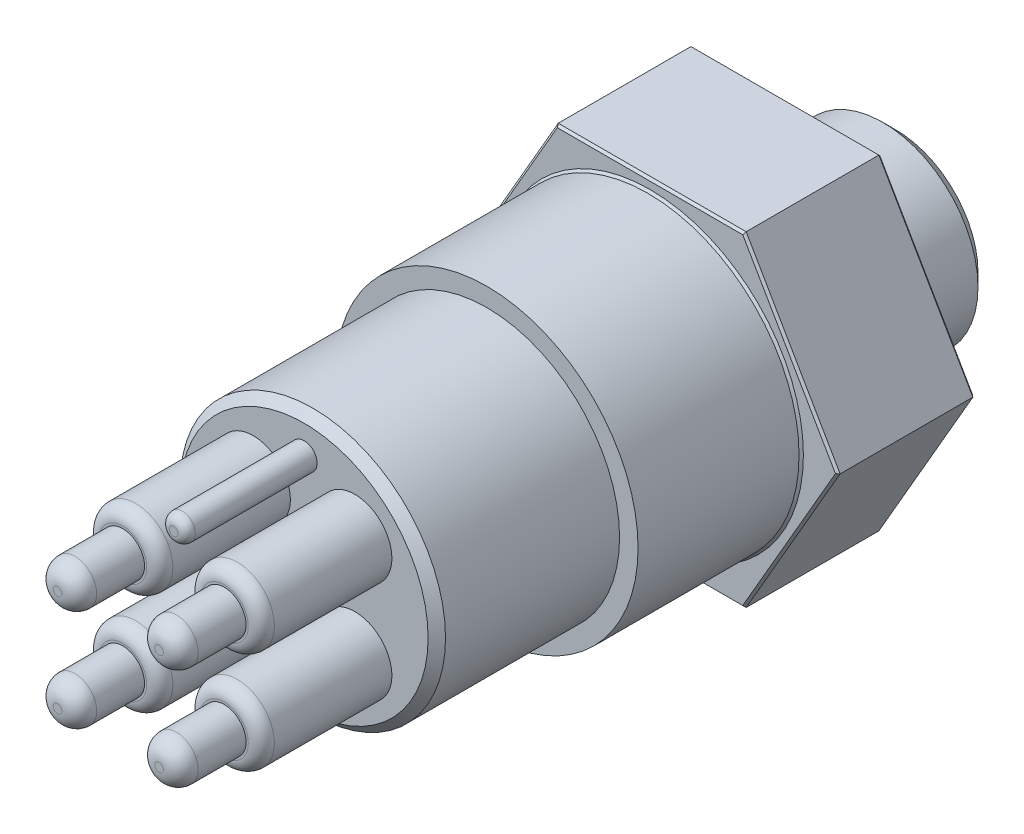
from build123d import *

# Parameters (mm, degrees)
SKETCH1_R        = 5.55625
POST_DEPTH       = 6.35
CHAMFER1_SIZE    = 0.762
HEX_2_DEPTH      = 8.001
SKETCH5_R        = 8.8265
EXTRUDE1_DEPTH   = 9.525
CHAMFER2_SIZE    = 0.127
SKETCH3_R        = 7.747
RUBBER_DEPTH     = 10.668
CHAMFER3_SIZE    = 0.508
SKETCH4_R        = 0.762
SKETCH4_R_2      = 2.159
PINS_DEPTH       = 7.62
SKETCH6_R        = 1.27
PIN_TIPS_DEPTH   = 3.81
PIN_TIP_RADIUS_R = 1.016
GUIDE_PIT_TIP_R  = 0.508
FILLET3_R        = 0.762


with BuildPart() as part:
    # Sketch1 → post (new body)
    with BuildSketch(Plane.XY):
        Circle(SKETCH1_R)
    extrude(amount=-POST_DEPTH)

    # Chamfer1
    chamfer1_edges = [part.edges().sort_by_distance(p)[0] for p in [
        (-5.55625, 0, -6.35),
    ]]
    chamfer(chamfer1_edges, length=CHAMFER1_SIZE)

    # Sketch2 → hex 2 (add)
    with BuildSketch(Plane.XY):
        Polygon((-5.484596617, 9.4996), (-10.969193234, 0), (-5.484596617, -9.4996), (5.484596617, -9.4996), (10.969193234, 0), (5.484596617, 9.4996), align=None)
    extrude(amount=HEX_2_DEPTH)

    # Sketch5 → Extrude1 (add)
    with BuildSketch(Plane.XY.offset(8.001)):
        with Locations(Location((0, 0, 0), (0, 0, 180))):
            Circle(SKETCH5_R)
    extrude(amount=EXTRUDE1_DEPTH)

    # Chamfer2
    chamfer2_edges = [part.edges().sort_by_distance(p)[0] for p in [
        (8.226894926, 4.7498, 0),
        (0, 9.4996, 8.001),
        (-8.226894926, 4.7498, 8.001),
        (-8.226894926, -4.7498, 8.001),
        (0, -9.4996, 8.001),
        (8.226894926, -4.7498, 8.001),
        (8.226894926, 4.7498, 8.001),
        (8.8265, 0, 8.001),
        (0, 9.4996, 0),
        (-8.226894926, -4.7498, 0),
        (0, -9.4996, 0),
        (8.226894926, -4.7498, 0),
    ]]
    chamfer(chamfer2_edges, length=CHAMFER2_SIZE)

    # Sketch3 → rubber (add)
    with BuildSketch(Plane.XY.offset(17.526)):
        Circle(SKETCH3_R)
    extrude(amount=RUBBER_DEPTH)

    # Chamfer3
    chamfer3_edges = [part.edges().sort_by_distance(p)[0] for p in [
        (-7.747, 0, 28.194),
    ]]
    chamfer(chamfer3_edges, length=CHAMFER3_SIZE)

    # Sketch4 → PINS (add)
    with BuildSketch(Plane.XY.offset(28.194)):
        with Locations(Location((0, 5.588, 0), (0, 0, 180))):
            Circle(SKETCH4_R)
        with Locations(Location((2.96348452, -2.96348452, 0), (0, 0, 180))):
            Circle(SKETCH4_R_2)
        with Locations(Location((-2.96348452, 2.96348452, 0), (0, 0, 180))):
            Circle(SKETCH4_R_2)
        with Locations(Location((-2.96348452, -2.96348452, 0), (0, 0, 180))):
            Circle(SKETCH4_R_2)
        with Locations(Location((2.96348452, 2.96348452, 0), (0, 0, 180))):
            Circle(SKETCH4_R_2)
    extrude(amount=PINS_DEPTH)

    # Sketch6 → pin tips (add)
    with BuildSketch(Plane.XY.offset(35.814)):
        with Locations(Location((-2.96348452, 2.96348452, 0), (0, 0, 180))):
            Circle(SKETCH6_R)
        with Locations(Location((-2.96348452, -2.96348452, 0), (0, 0, 180))):
            Circle(SKETCH6_R)
        with Locations(Location((2.96348452, 2.96348452, 0), (0, 0, 180))):
            Circle(SKETCH6_R)
        with Locations(Location((2.96348452, -2.96348452, 0), (0, 0, 180))):
            Circle(SKETCH6_R)
    extrude(amount=PIN_TIPS_DEPTH)

    # pin tip radius
    pin_tip_radius_edges = [part.edges().sort_by_distance(p)[0] for p in [
        (4.23348452, 2.96348452, 39.624),
        (4.23348452, -2.96348452, 39.624),
        (-1.69348452, 2.96348452, 39.624),
        (-1.69348452, -2.96348452, 39.624),
    ]]
    fillet(pin_tip_radius_edges, radius=PIN_TIP_RADIUS_R)

    # guide pit tip
    guide_pit_tip_edges = [part.edges().sort_by_distance(p)[0] for p in [
        (0.762, 5.588, 35.814),
    ]]
    fillet(guide_pit_tip_edges, radius=GUIDE_PIT_TIP_R)

    # Fillet3
    fillet3_edges = [part.edges().sort_by_distance(p)[0] for p in [
        (5.12248452, -2.96348452, 35.814),
        (-0.80448452, 2.96348452, 35.814),
        (-0.80448452, -2.96348452, 35.814),
        (5.12248452, 2.96348452, 35.814),
    ]]
    fillet(fillet3_edges, radius=FILLET3_R)


solid = part.part
